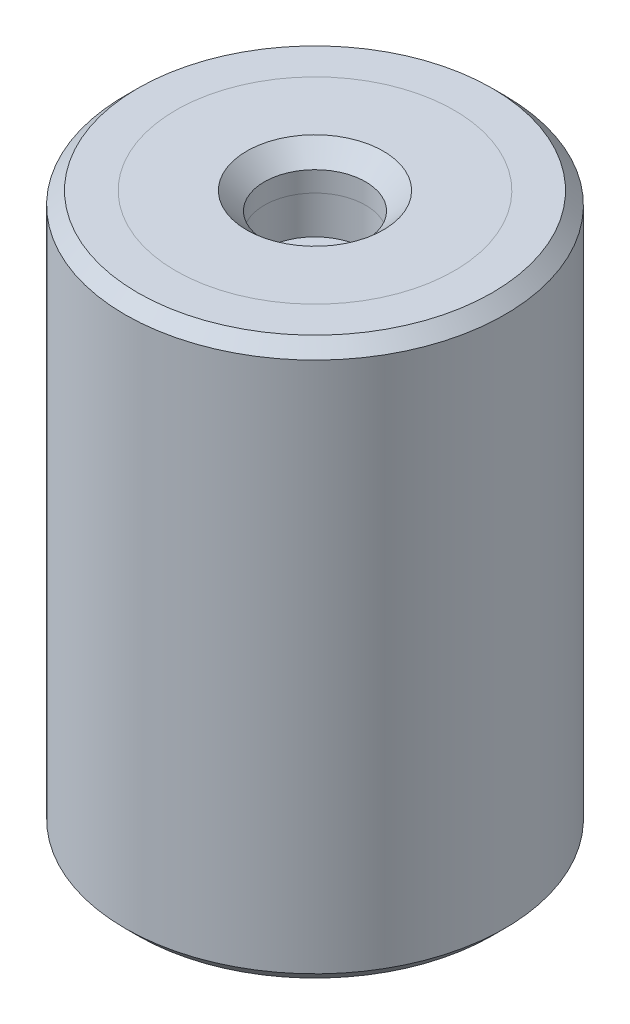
ISO-10303-21;
HEADER;
FILE_DESCRIPTION(('STEP AP214'),'2;1');
FILE_NAME('part.step','',(''),(''),'','','');
FILE_SCHEMA(('AUTOMOTIVE_DESIGN { 1 0 10303 214 1 1 1 1 }'));
ENDSEC;
DATA;
#1=APPLICATION_CONTEXT('core data for automotive mechanical design processes');
#2=APPLICATION_PROTOCOL_DEFINITION('international standard','automotive_design',2000,#1);
#3=PRODUCT_CONTEXT('',#1,'mechanical');
#4=PRODUCT('Part','Part','',(#3));
#5=PRODUCT_RELATED_PRODUCT_CATEGORY('part','',(#4));
#6=PRODUCT_DEFINITION_FORMATION('','',#4);
#7=PRODUCT_DEFINITION_CONTEXT('part definition',#1,'design');
#8=PRODUCT_DEFINITION('design','',#6,#7);
#9=PRODUCT_DEFINITION_SHAPE('','',#8);
#10=(LENGTH_UNIT() NAMED_UNIT(*) SI_UNIT(.MILLI.,.METRE.));
#11=(NAMED_UNIT(*) PLANE_ANGLE_UNIT() SI_UNIT($,.RADIAN.));
#12=(NAMED_UNIT(*) SI_UNIT($,.STERADIAN.) SOLID_ANGLE_UNIT());
#13=UNCERTAINTY_MEASURE_WITH_UNIT(LENGTH_MEASURE(1.E-05),#10,'distance_accuracy_value','');
#14=(GEOMETRIC_REPRESENTATION_CONTEXT(3) GLOBAL_UNCERTAINTY_ASSIGNED_CONTEXT((#13)) GLOBAL_UNIT_ASSIGNED_CONTEXT((#10,
#11,#12)) REPRESENTATION_CONTEXT('',''));
#15=CARTESIAN_POINT('',(0.,0.,0.));
#16=DIRECTION('',(0.,0.,1.));
#17=DIRECTION('',(1.,0.,0.));
#18=AXIS2_PLACEMENT_3D('',#15,#16,#17);
#19=CARTESIAN_POINT('',(0.,49.0340428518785,0.));
#20=DIRECTION('',(0.,1.,0.));
#21=DIRECTION('',(0.,0.,1.));
#22=AXIS2_PLACEMENT_3D('',#19,#20,#21);
#23=CYLINDRICAL_SURFACE('',#22,2.);
#24=CARTESIAN_POINT('',(0.,-19.8,0.));
#25=DIRECTION('',(0.,-1.,0.));
#26=DIRECTION('',(0.,0.,-1.));
#27=AXIS2_PLACEMENT_3D('',#24,#25,#26);
#28=CIRCLE('',#27,2.);
#29=CARTESIAN_POINT('',(0.,-19.8,-2.));
#30=VERTEX_POINT('',#29);
#31=EDGE_CURVE('P0_E10',#30,#30,#28,.T.);
#32=ORIENTED_EDGE('',*,*,#31,.T.);
#33=EDGE_LOOP('',(#32));
#34=FACE_BOUND('',#33,.T.);
#35=CARTESIAN_POINT('',(0.,-19.,0.));
#36=DIRECTION('',(0.,1.,0.));
#37=DIRECTION('',(0.,0.,1.));
#38=AXIS2_PLACEMENT_3D('',#35,#36,#37);
#39=CIRCLE('',#38,2.);
#40=CARTESIAN_POINT('',(0.,-19.,2.));
#41=VERTEX_POINT('',#40);
#42=EDGE_CURVE('P0_E25',#41,#41,#39,.T.);
#43=ORIENTED_EDGE('',*,*,#42,.T.);
#44=EDGE_LOOP('',(#43));
#45=FACE_BOUND('',#44,.T.);
#46=ADVANCED_FACE('P0_F14',(#34,#45),#23,.F.);
#47=CARTESIAN_POINT('',(0.,-19.,2.));
#48=DIRECTION('',(0.,1.,0.));
#49=DIRECTION('',(0.,0.,1.));
#50=AXIS2_PLACEMENT_3D('',#47,#48,#49);
#51=PLANE('',#50);
#52=CARTESIAN_POINT('',(0.,-19.,0.));
#53=DIRECTION('',(0.,1.,0.));
#54=DIRECTION('',(0.,0.,1.));
#55=AXIS2_PLACEMENT_3D('',#52,#53,#54);
#56=CIRCLE('',#55,5.5);
#57=CARTESIAN_POINT('',(0.,-19.,5.5));
#58=VERTEX_POINT('',#57);
#59=EDGE_CURVE('P0_E29',#58,#58,#56,.T.);
#60=ORIENTED_EDGE('',*,*,#59,.T.);
#61=EDGE_LOOP('',(#60));
#62=FACE_BOUND('',#61,.T.);
#63=ORIENTED_EDGE('',*,*,#42,.F.);
#64=EDGE_LOOP('',(#63));
#65=FACE_BOUND('',#64,.T.);
#66=ADVANCED_FACE('P0_F50',(#62,#65),#51,.T.);
#67=CARTESIAN_POINT('',(0.,49.0340428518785,0.));
#68=DIRECTION('',(0.,1.,0.));
#69=DIRECTION('',(0.,0.,1.));
#70=AXIS2_PLACEMENT_3D('',#67,#68,#69);
#71=CYLINDRICAL_SURFACE('',#70,5.5);
#72=CARTESIAN_POINT('',(0.,-20.5,0.));
#73=DIRECTION('',(0.,1.,0.));
#74=DIRECTION('',(0.,0.,1.));
#75=AXIS2_PLACEMENT_3D('',#72,#73,#74);
#76=CIRCLE('',#75,5.5);
#77=CARTESIAN_POINT('',(0.,-20.5,5.5));
#78=VERTEX_POINT('',#77);
#79=EDGE_CURVE('P0_E34',#78,#78,#76,.T.);
#80=ORIENTED_EDGE('',*,*,#79,.T.);
#81=EDGE_LOOP('',(#80));
#82=FACE_BOUND('',#81,.T.);
#83=ORIENTED_EDGE('',*,*,#59,.F.);
#84=EDGE_LOOP('',(#83));
#85=FACE_BOUND('',#84,.T.);
#86=ADVANCED_FACE('P0_F38',(#82,#85),#71,.T.);
#87=CARTESIAN_POINT('',(0.,-20.5,5.5));
#88=DIRECTION('',(0.,-1.,0.));
#89=DIRECTION('',(0.,0.,-1.));
#90=AXIS2_PLACEMENT_3D('',#87,#88,#89);
#91=PLANE('',#90);
#92=CARTESIAN_POINT('',(0.,-20.5,0.));
#93=DIRECTION('',(0.,-1.,0.));
#94=DIRECTION('',(0.,0.,-1.));
#95=AXIS2_PLACEMENT_3D('',#92,#93,#94);
#96=CIRCLE('',#95,2.7);
#97=CARTESIAN_POINT('',(0.,-20.5,-2.7));
#98=VERTEX_POINT('',#97);
#99=EDGE_CURVE('P0_E21',#98,#98,#96,.F.);
#100=ORIENTED_EDGE('',*,*,#99,.T.);
#101=EDGE_LOOP('',(#100));
#102=FACE_BOUND('',#101,.T.);
#103=ORIENTED_EDGE('',*,*,#79,.F.);
#104=EDGE_LOOP('',(#103));
#105=FACE_BOUND('',#104,.T.);
#106=ADVANCED_FACE('P0_F41',(#102,#105),#91,.T.);
#107=CARTESIAN_POINT('',(0.,-20.5,0.));
#108=DIRECTION('',(0.,-1.,0.));
#109=DIRECTION('',(0.,0.,-1.));
#110=AXIS2_PLACEMENT_3D('',#107,#108,#109);
#111=CONICAL_SURFACE('',#110,2.7,0.785398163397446);
#112=ORIENTED_EDGE('',*,*,#31,.F.);
#113=EDGE_LOOP('',(#112));
#114=FACE_BOUND('',#113,.T.);
#115=ORIENTED_EDGE('',*,*,#99,.F.);
#116=EDGE_LOOP('',(#115));
#117=FACE_BOUND('',#116,.T.);
#118=ADVANCED_FACE('P0_F16',(#114,#117),#111,.F.);
#119=CLOSED_SHELL('',(#46,#66,#86,#106,#118));
#120=MANIFOLD_SOLID_BREP('P0_B1',#119);
#121=CARTESIAN_POINT('',(0.,69.5340428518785,0.));
#122=DIRECTION('',(0.,1.,0.));
#123=DIRECTION('',(0.,0.,1.));
#124=AXIS2_PLACEMENT_3D('',#121,#122,#123);
#125=CYLINDRICAL_SURFACE('',#124,2.);
#126=CARTESIAN_POINT('',(0.,0.800000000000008,0.));
#127=DIRECTION('',(0.,1.,0.));
#128=DIRECTION('',(0.,0.,1.));
#129=AXIS2_PLACEMENT_3D('',#126,#127,#128);
#130=CIRCLE('',#129,2.);
#131=CARTESIAN_POINT('',(0.,0.800000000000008,2.));
#132=VERTEX_POINT('',#131);
#133=EDGE_CURVE('P1_E21',#132,#132,#130,.T.);
#134=ORIENTED_EDGE('',*,*,#133,.T.);
#135=EDGE_LOOP('',(#134));
#136=FACE_BOUND('',#135,.T.);
#137=CARTESIAN_POINT('',(0.,0.,0.));
#138=DIRECTION('',(0.,1.,0.));
#139=DIRECTION('',(0.,0.,1.));
#140=AXIS2_PLACEMENT_3D('',#137,#138,#139);
#141=CIRCLE('',#140,2.);
#142=CARTESIAN_POINT('',(0.,0.,2.));
#143=VERTEX_POINT('',#142);
#144=EDGE_CURVE('P1_E34',#143,#143,#141,.T.);
#145=ORIENTED_EDGE('',*,*,#144,.F.);
#146=EDGE_LOOP('',(#145));
#147=FACE_BOUND('',#146,.T.);
#148=ADVANCED_FACE('P1_F14',(#136,#147),#125,.F.);
#149=CARTESIAN_POINT('',(0.,1.5,2.));
#150=DIRECTION('',(0.,1.,0.));
#151=DIRECTION('',(0.,0.,1.));
#152=AXIS2_PLACEMENT_3D('',#149,#150,#151);
#153=PLANE('',#152);
#154=CARTESIAN_POINT('',(0.,1.5,0.));
#155=DIRECTION('',(0.,1.,0.));
#156=DIRECTION('',(0.,0.,1.));
#157=AXIS2_PLACEMENT_3D('',#154,#155,#156);
#158=CIRCLE('',#157,2.7);
#159=CARTESIAN_POINT('',(0.,1.5,2.7));
#160=VERTEX_POINT('',#159);
#161=EDGE_CURVE('P1_E10',#160,#160,#158,.F.);
#162=ORIENTED_EDGE('',*,*,#161,.T.);
#163=EDGE_LOOP('',(#162));
#164=FACE_BOUND('',#163,.T.);
#165=CARTESIAN_POINT('',(0.,1.5,0.));
#166=DIRECTION('',(0.,1.,0.));
#167=DIRECTION('',(0.,0.,1.));
#168=AXIS2_PLACEMENT_3D('',#165,#166,#167);
#169=CIRCLE('',#168,5.5);
#170=CARTESIAN_POINT('',(0.,1.5,5.5));
#171=VERTEX_POINT('',#170);
#172=EDGE_CURVE('P1_E25',#171,#171,#169,.T.);
#173=ORIENTED_EDGE('',*,*,#172,.T.);
#174=EDGE_LOOP('',(#173));
#175=FACE_BOUND('',#174,.T.);
#176=ADVANCED_FACE('P1_F42',(#164,#175),#153,.T.);
#177=CARTESIAN_POINT('',(0.,69.5340428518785,0.));
#178=DIRECTION('',(0.,1.,0.));
#179=DIRECTION('',(0.,0.,1.));
#180=AXIS2_PLACEMENT_3D('',#177,#178,#179);
#181=CYLINDRICAL_SURFACE('',#180,5.5);
#182=CARTESIAN_POINT('',(0.,0.,0.));
#183=DIRECTION('',(0.,1.,0.));
#184=DIRECTION('',(0.,0.,1.));
#185=AXIS2_PLACEMENT_3D('',#182,#183,#184);
#186=CIRCLE('',#185,5.5);
#187=CARTESIAN_POINT('',(0.,0.,5.5));
#188=VERTEX_POINT('',#187);
#189=EDGE_CURVE('P1_E29',#188,#188,#186,.T.);
#190=ORIENTED_EDGE('',*,*,#189,.T.);
#191=EDGE_LOOP('',(#190));
#192=FACE_BOUND('',#191,.T.);
#193=ORIENTED_EDGE('',*,*,#172,.F.);
#194=EDGE_LOOP('',(#193));
#195=FACE_BOUND('',#194,.T.);
#196=ADVANCED_FACE('P1_F47',(#192,#195),#181,.T.);
#197=CARTESIAN_POINT('',(0.,0.,5.5));
#198=DIRECTION('',(0.,-1.,0.));
#199=DIRECTION('',(0.,0.,-1.));
#200=AXIS2_PLACEMENT_3D('',#197,#198,#199);
#201=PLANE('',#200);
#202=ORIENTED_EDGE('',*,*,#144,.T.);
#203=EDGE_LOOP('',(#202));
#204=FACE_BOUND('',#203,.T.);
#205=ORIENTED_EDGE('',*,*,#189,.F.);
#206=EDGE_LOOP('',(#205));
#207=FACE_BOUND('',#206,.T.);
#208=ADVANCED_FACE('P1_F38',(#204,#207),#201,.T.);
#209=CARTESIAN_POINT('',(0.,0.800000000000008,0.));
#210=DIRECTION('',(0.,1.,0.));
#211=DIRECTION('',(0.,0.,1.));
#212=AXIS2_PLACEMENT_3D('',#209,#210,#211);
#213=CONICAL_SURFACE('',#212,2.,0.785398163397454);
#214=ORIENTED_EDGE('',*,*,#161,.F.);
#215=EDGE_LOOP('',(#214));
#216=FACE_BOUND('',#215,.T.);
#217=ORIENTED_EDGE('',*,*,#133,.F.);
#218=EDGE_LOOP('',(#217));
#219=FACE_BOUND('',#218,.T.);
#220=ADVANCED_FACE('P1_F16',(#216,#219),#213,.F.);
#221=CLOSED_SHELL('',(#148,#176,#196,#208,#220));
#222=MANIFOLD_SOLID_BREP('P1_B1',#221);
#223=CARTESIAN_POINT('',(0.,0.,0.));
#224=DIRECTION('',(0.,1.,0.));
#225=DIRECTION('',(0.,0.,1.));
#226=AXIS2_PLACEMENT_3D('',#223,#224,#225);
#227=PLANE('',#226);
#228=CARTESIAN_POINT('',(0.,0.,0.));
#229=DIRECTION('',(0.,1.,0.));
#230=DIRECTION('',(0.,0.,1.));
#231=AXIS2_PLACEMENT_3D('',#228,#229,#230);
#232=CIRCLE('',#231,2.);
#233=CARTESIAN_POINT('',(0.,0.,2.));
#234=VERTEX_POINT('',#233);
#235=EDGE_CURVE('P2_E46',#234,#234,#232,.T.);
#236=ORIENTED_EDGE('',*,*,#235,.F.);
#237=EDGE_LOOP('',(#236));
#238=FACE_BOUND('',#237,.T.);
#239=CARTESIAN_POINT('',(0.,0.,0.));
#240=DIRECTION('',(0.,1.,0.));
#241=DIRECTION('',(0.,0.,1.));
#242=AXIS2_PLACEMENT_3D('',#239,#240,#241);
#243=CIRCLE('',#242,5.5);
#244=CARTESIAN_POINT('',(0.,0.,5.5));
#245=VERTEX_POINT('',#244);
#246=EDGE_CURVE('P2_E33',#245,#245,#243,.T.);
#247=ORIENTED_EDGE('',*,*,#246,.T.);
#248=EDGE_LOOP('',(#247));
#249=FACE_BOUND('',#248,.T.);
#250=ADVANCED_FACE('P2_F13',(#238,#249),#227,.T.);
#251=CARTESIAN_POINT('',(0.,65.5134936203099,0.));
#252=DIRECTION('',(0.,1.,0.));
#253=DIRECTION('',(0.,0.,1.));
#254=AXIS2_PLACEMENT_3D('',#251,#252,#253);
#255=CYLINDRICAL_SURFACE('',#254,5.5);
#256=CARTESIAN_POINT('',(0.,1.5,0.));
#257=DIRECTION('',(0.,1.,0.));
#258=DIRECTION('',(0.,0.,1.));
#259=AXIS2_PLACEMENT_3D('',#256,#257,#258);
#260=CIRCLE('',#259,5.5);
#261=CARTESIAN_POINT('',(0.,1.5,5.5));
#262=VERTEX_POINT('',#261);
#263=EDGE_CURVE('P2_E36',#262,#262,#260,.T.);
#264=ORIENTED_EDGE('',*,*,#263,.T.);
#265=EDGE_LOOP('',(#264));
#266=FACE_BOUND('',#265,.T.);
#267=ORIENTED_EDGE('',*,*,#246,.F.);
#268=EDGE_LOOP('',(#267));
#269=FACE_BOUND('',#268,.T.);
#270=ADVANCED_FACE('P2_F92',(#266,#269),#255,.F.);
#271=CARTESIAN_POINT('',(0.,1.5,5.5));
#272=DIRECTION('',(0.,1.,0.));
#273=DIRECTION('',(0.,0.,1.));
#274=AXIS2_PLACEMENT_3D('',#271,#272,#273);
#275=PLANE('',#274);
#276=CARTESIAN_POINT('',(0.,1.5,0.));
#277=DIRECTION('',(0.,1.,0.));
#278=DIRECTION('',(0.,0.,1.));
#279=AXIS2_PLACEMENT_3D('',#276,#277,#278);
#280=CIRCLE('',#279,7.00000000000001);
#281=CARTESIAN_POINT('',(0.,1.5,7.00000000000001));
#282=VERTEX_POINT('',#281);
#283=EDGE_CURVE('P2_E9',#282,#282,#280,.T.);
#284=ORIENTED_EDGE('',*,*,#283,.T.);
#285=EDGE_LOOP('',(#284));
#286=FACE_BOUND('',#285,.T.);
#287=ORIENTED_EDGE('',*,*,#263,.F.);
#288=EDGE_LOOP('',(#287));
#289=FACE_BOUND('',#288,.T.);
#290=ADVANCED_FACE('P2_F88',(#286,#289),#275,.T.);
#291=CARTESIAN_POINT('',(0.,65.5134936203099,0.));
#292=DIRECTION('',(0.,1.,0.));
#293=DIRECTION('',(0.,0.,1.));
#294=AXIS2_PLACEMENT_3D('',#291,#292,#293);
#295=CYLINDRICAL_SURFACE('',#294,7.5);
#296=CARTESIAN_POINT('',(0.,-20.,0.));
#297=DIRECTION('',(0.,-1.,0.));
#298=DIRECTION('',(0.,0.,-1.));
#299=AXIS2_PLACEMENT_3D('',#296,#297,#298);
#300=CIRCLE('',#299,7.5);
#301=CARTESIAN_POINT('',(0.,-20.,-7.5));
#302=VERTEX_POINT('',#301);
#303=EDGE_CURVE('P2_E24',#302,#302,#300,.F.);
#304=ORIENTED_EDGE('',*,*,#303,.T.);
#305=EDGE_LOOP('',(#304));
#306=FACE_BOUND('',#305,.T.);
#307=CARTESIAN_POINT('',(0.,1.,0.));
#308=DIRECTION('',(0.,1.,0.));
#309=DIRECTION('',(0.,0.,1.));
#310=AXIS2_PLACEMENT_3D('',#307,#308,#309);
#311=CIRCLE('',#310,7.5);
#312=CARTESIAN_POINT('',(0.,1.,7.5));
#313=VERTEX_POINT('',#312);
#314=EDGE_CURVE('P2_E28',#313,#313,#311,.F.);
#315=ORIENTED_EDGE('',*,*,#314,.T.);
#316=EDGE_LOOP('',(#315));
#317=FACE_BOUND('',#316,.T.);
#318=ADVANCED_FACE('P2_F82',(#306,#317),#295,.T.);
#319=CARTESIAN_POINT('',(0.,-20.5,7.5));
#320=DIRECTION('',(0.,-1.,0.));
#321=DIRECTION('',(0.,0.,-1.));
#322=AXIS2_PLACEMENT_3D('',#319,#320,#321);
#323=PLANE('',#322);
#324=CARTESIAN_POINT('',(0.,-20.5,0.));
#325=DIRECTION('',(0.,-1.,0.));
#326=DIRECTION('',(0.,0.,-1.));
#327=AXIS2_PLACEMENT_3D('',#324,#325,#326);
#328=CIRCLE('',#327,7.);
#329=CARTESIAN_POINT('',(0.,-20.5,-7.));
#330=VERTEX_POINT('',#329);
#331=EDGE_CURVE('P2_E20',#330,#330,#328,.T.);
#332=ORIENTED_EDGE('',*,*,#331,.T.);
#333=EDGE_LOOP('',(#332));
#334=FACE_BOUND('',#333,.T.);
#335=CARTESIAN_POINT('',(0.,-20.5,0.));
#336=DIRECTION('',(0.,1.,0.));
#337=DIRECTION('',(0.,0.,1.));
#338=AXIS2_PLACEMENT_3D('',#335,#336,#337);
#339=CIRCLE('',#338,5.49999999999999);
#340=CARTESIAN_POINT('',(0.,-20.5,5.49999999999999));
#341=VERTEX_POINT('',#340);
#342=EDGE_CURVE('P2_E39',#341,#341,#339,.T.);
#343=ORIENTED_EDGE('',*,*,#342,.T.);
#344=EDGE_LOOP('',(#343));
#345=FACE_BOUND('',#344,.T.);
#346=ADVANCED_FACE('P2_F77',(#334,#345),#323,.T.);
#347=CARTESIAN_POINT('',(0.,65.5134936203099,0.));
#348=DIRECTION('',(0.,1.,0.));
#349=DIRECTION('',(0.,0.,1.));
#350=AXIS2_PLACEMENT_3D('',#347,#348,#349);
#351=CYLINDRICAL_SURFACE('',#350,5.49999999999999);
#352=CARTESIAN_POINT('',(0.,-19.,0.));
#353=DIRECTION('',(0.,1.,0.));
#354=DIRECTION('',(0.,0.,1.));
#355=AXIS2_PLACEMENT_3D('',#352,#353,#354);
#356=CIRCLE('',#355,5.49999999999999);
#357=CARTESIAN_POINT('',(0.,-19.,5.49999999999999));
#358=VERTEX_POINT('',#357);
#359=EDGE_CURVE('P2_E42',#358,#358,#356,.T.);
#360=ORIENTED_EDGE('',*,*,#359,.T.);
#361=EDGE_LOOP('',(#360));
#362=FACE_BOUND('',#361,.T.);
#363=ORIENTED_EDGE('',*,*,#342,.F.);
#364=EDGE_LOOP('',(#363));
#365=FACE_BOUND('',#364,.T.);
#366=ADVANCED_FACE('P2_F71',(#362,#365),#351,.F.);
#367=CARTESIAN_POINT('',(0.,-19.,5.49999999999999));
#368=DIRECTION('',(0.,-1.,0.));
#369=DIRECTION('',(0.,0.,-1.));
#370=AXIS2_PLACEMENT_3D('',#367,#368,#369);
#371=PLANE('',#370);
#372=CARTESIAN_POINT('',(0.,-19.,0.));
#373=DIRECTION('',(0.,-1.,0.));
#374=DIRECTION('',(0.,0.,-1.));
#375=AXIS2_PLACEMENT_3D('',#372,#373,#374);
#376=CIRCLE('',#375,2.);
#377=CARTESIAN_POINT('',(0.,-19.,-2.));
#378=VERTEX_POINT('',#377);
#379=EDGE_CURVE('P2_E52',#378,#378,#376,.T.);
#380=ORIENTED_EDGE('',*,*,#379,.F.);
#381=EDGE_LOOP('',(#380));
#382=FACE_BOUND('',#381,.T.);
#383=ORIENTED_EDGE('',*,*,#359,.F.);
#384=EDGE_LOOP('',(#383));
#385=FACE_BOUND('',#384,.T.);
#386=ADVANCED_FACE('P2_F67',(#382,#385),#371,.T.);
#387=CARTESIAN_POINT('',(0.,-20.,0.));
#388=DIRECTION('',(0.,1.,0.));
#389=DIRECTION('',(0.,0.,1.));
#390=AXIS2_PLACEMENT_3D('',#387,#388,#389);
#391=CONICAL_SURFACE('',#390,7.5,0.785398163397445);
#392=ORIENTED_EDGE('',*,*,#331,.F.);
#393=EDGE_LOOP('',(#392));
#394=FACE_BOUND('',#393,.T.);
#395=ORIENTED_EDGE('',*,*,#303,.F.);
#396=EDGE_LOOP('',(#395));
#397=FACE_BOUND('',#396,.T.);
#398=ADVANCED_FACE('P2_F70',(#394,#397),#391,.T.);
#399=CARTESIAN_POINT('',(0.,1.5,0.));
#400=DIRECTION('',(0.,-1.,0.));
#401=DIRECTION('',(0.,0.,-1.));
#402=AXIS2_PLACEMENT_3D('',#399,#400,#401);
#403=CONICAL_SURFACE('',#402,7.00000000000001,0.78539816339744);
#404=ORIENTED_EDGE('',*,*,#314,.F.);
#405=EDGE_LOOP('',(#404));
#406=FACE_BOUND('',#405,.T.);
#407=ORIENTED_EDGE('',*,*,#283,.F.);
#408=EDGE_LOOP('',(#407));
#409=FACE_BOUND('',#408,.T.);
#410=ADVANCED_FACE('P2_F15',(#406,#409),#403,.T.);
#411=CARTESIAN_POINT('',(0.,-1.5,0.));
#412=DIRECTION('',(0.,1.,0.));
#413=DIRECTION('',(0.,0.,1.));
#414=AXIS2_PLACEMENT_3D('',#411,#412,#413);
#415=CYLINDRICAL_SURFACE('',#414,2.);
#416=CARTESIAN_POINT('',(0.,-1.5,0.));
#417=DIRECTION('',(0.,1.,0.));
#418=DIRECTION('',(0.,0.,1.));
#419=AXIS2_PLACEMENT_3D('',#416,#417,#418);
#420=CIRCLE('',#419,2.);
#421=CARTESIAN_POINT('',(0.,-1.5,2.));
#422=VERTEX_POINT('',#421);
#423=EDGE_CURVE('P2_E45',#422,#422,#420,.T.);
#424=ORIENTED_EDGE('',*,*,#423,.F.);
#425=EDGE_LOOP('',(#424));
#426=FACE_BOUND('',#425,.T.);
#427=ORIENTED_EDGE('',*,*,#235,.T.);
#428=EDGE_LOOP('',(#427));
#429=FACE_BOUND('',#428,.T.);
#430=ADVANCED_FACE('P2_F108',(#426,#429),#415,.F.);
#431=CARTESIAN_POINT('',(0.,-1.5,0.));
#432=DIRECTION('',(0.,1.,0.));
#433=DIRECTION('',(0.,0.,1.));
#434=AXIS2_PLACEMENT_3D('',#431,#432,#433);
#435=PLANE('',#434);
#436=ORIENTED_EDGE('',*,*,#423,.T.);
#437=EDGE_LOOP('',(#436));
#438=FACE_BOUND('',#437,.T.);
#439=ADVANCED_FACE('P2_F63',(#438),#435,.T.);
#440=CARTESIAN_POINT('',(0.,-17.5,0.));
#441=DIRECTION('',(0.,-1.,0.));
#442=DIRECTION('',(0.,0.,-1.));
#443=AXIS2_PLACEMENT_3D('',#440,#441,#442);
#444=CYLINDRICAL_SURFACE('',#443,2.);
#445=CARTESIAN_POINT('',(0.,-17.5,0.));
#446=DIRECTION('',(0.,-1.,0.));
#447=DIRECTION('',(0.,0.,-1.));
#448=AXIS2_PLACEMENT_3D('',#445,#446,#447);
#449=CIRCLE('',#448,2.);
#450=CARTESIAN_POINT('',(0.,-17.5,-2.));
#451=VERTEX_POINT('',#450);
#452=EDGE_CURVE('P2_E49',#451,#451,#449,.T.);
#453=ORIENTED_EDGE('',*,*,#452,.F.);
#454=EDGE_LOOP('',(#453));
#455=FACE_BOUND('',#454,.T.);
#456=ORIENTED_EDGE('',*,*,#379,.T.);
#457=EDGE_LOOP('',(#456));
#458=FACE_BOUND('',#457,.T.);
#459=ADVANCED_FACE('P2_F60',(#455,#458),#444,.F.);
#460=CARTESIAN_POINT('',(0.,-17.5,0.));
#461=DIRECTION('',(0.,-1.,0.));
#462=DIRECTION('',(0.,0.,-1.));
#463=AXIS2_PLACEMENT_3D('',#460,#461,#462);
#464=PLANE('',#463);
#465=ORIENTED_EDGE('',*,*,#452,.T.);
#466=EDGE_LOOP('',(#465));
#467=FACE_BOUND('',#466,.T.);
#468=ADVANCED_FACE('P2_F58',(#467),#464,.T.);
#469=CLOSED_SHELL('',(#250,#270,#290,#318,#346,#366,#386,#398,#410,#430,#439,#459,#468));
#470=MANIFOLD_SOLID_BREP('P2_B1',#469);
#471=ADVANCED_BREP_SHAPE_REPRESENTATION('',(#18,#120,#222,#470),#14);
#472=SHAPE_DEFINITION_REPRESENTATION(#9,#471);
ENDSEC;
END-ISO-10303-21;
